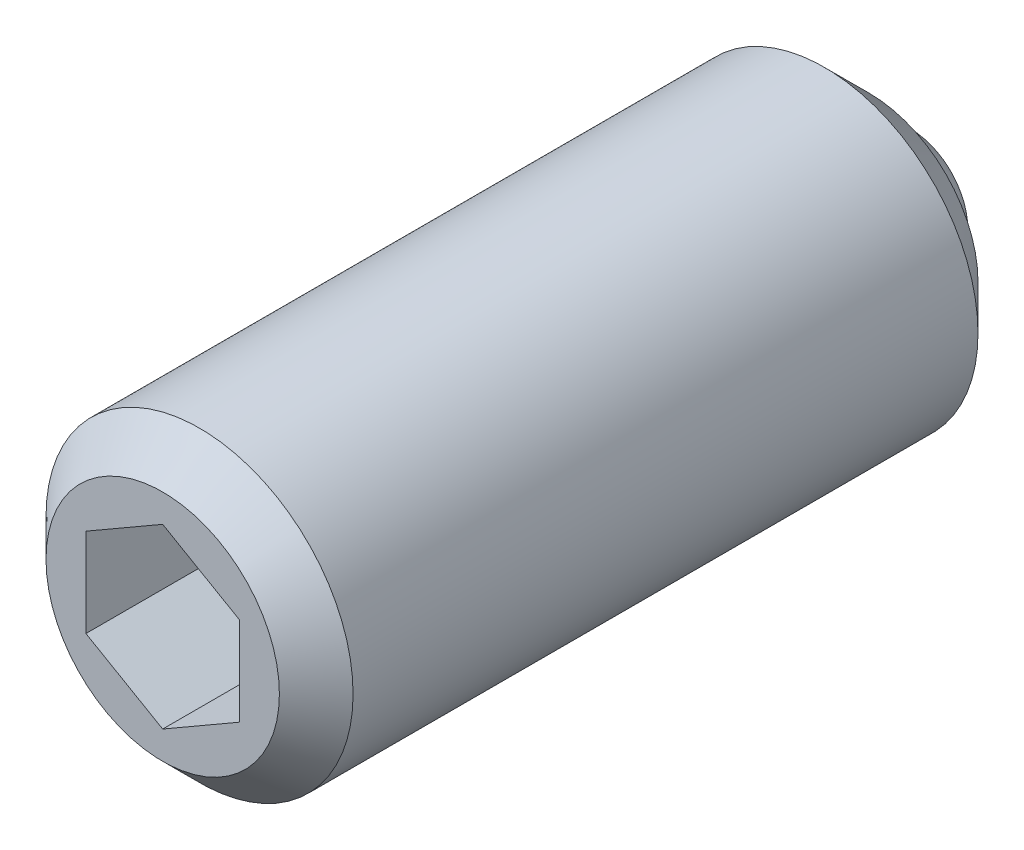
ISO-10303-21;
HEADER;
FILE_DESCRIPTION(('STEP AP214'),'2;1');
FILE_NAME('part.step','',(''),(''),'','','');
FILE_SCHEMA(('AUTOMOTIVE_DESIGN { 1 0 10303 214 1 1 1 1 }'));
ENDSEC;
DATA;
#1=APPLICATION_CONTEXT('core data for automotive mechanical design processes');
#2=APPLICATION_PROTOCOL_DEFINITION('international standard','automotive_design',2000,#1);
#3=PRODUCT_CONTEXT('',#1,'mechanical');
#4=PRODUCT('Part','Part','',(#3));
#5=PRODUCT_RELATED_PRODUCT_CATEGORY('part','',(#4));
#6=PRODUCT_DEFINITION_FORMATION('','',#4);
#7=PRODUCT_DEFINITION_CONTEXT('part definition',#1,'design');
#8=PRODUCT_DEFINITION('design','',#6,#7);
#9=PRODUCT_DEFINITION_SHAPE('','',#8);
#10=(LENGTH_UNIT() NAMED_UNIT(*) SI_UNIT(.MILLI.,.METRE.));
#11=(NAMED_UNIT(*) PLANE_ANGLE_UNIT() SI_UNIT($,.RADIAN.));
#12=(NAMED_UNIT(*) SI_UNIT($,.STERADIAN.) SOLID_ANGLE_UNIT());
#13=UNCERTAINTY_MEASURE_WITH_UNIT(LENGTH_MEASURE(1.E-05),#10,'distance_accuracy_value','');
#14=(GEOMETRIC_REPRESENTATION_CONTEXT(3) GLOBAL_UNCERTAINTY_ASSIGNED_CONTEXT((#13)) GLOBAL_UNIT_ASSIGNED_CONTEXT((#10,
#11,#12)) REPRESENTATION_CONTEXT('',''));
#15=CARTESIAN_POINT('',(0.,0.,0.));
#16=DIRECTION('',(0.,0.,1.));
#17=DIRECTION('',(1.,0.,0.));
#18=AXIS2_PLACEMENT_3D('',#15,#16,#17);
#19=CARTESIAN_POINT('',(2.500000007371,-2.92139236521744,20.9999999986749));
#20=DIRECTION('',(-3.50999936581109E-10,1.53211644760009E-10,-1.));
#21=DIRECTION('',(-1.,0.,3.50999936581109E-10));
#22=AXIS2_PLACEMENT_3D('',#19,#20,#21);
#23=PLANE('',#22);
#24=DIRECTION('',(-0.866025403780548,-0.500000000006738,2.27369039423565E-10));
#25=VECTOR('',#24,1.);
#26=CARTESIAN_POINT('',(-1.249999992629,2.16506350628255,21.0000000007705));
#27=LINE('',#26,#25);
#28=CARTESIAN_POINT('',(6.66551176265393E-09,2.88675134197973,21.0000000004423));
#29=VERTEX_POINT('',#28);
#30=CARTESIAN_POINT('',(-2.499999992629,1.44337566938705,21.0000000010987));
#31=VERTEX_POINT('',#30);
#32=EDGE_CURVE('E160',#29,#31,#27,.T.);
#33=ORIENTED_EDGE('',*,*,#32,.T.);
#34=DIRECTION('',(0.,-1.,-1.53211644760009E-10));
#35=VECTOR('',#34,1.);
#36=CARTESIAN_POINT('',(-2.499999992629,-3.21744416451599E-09,21.0000000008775));
#37=LINE('',#36,#35);
#38=CARTESIAN_POINT('',(-2.499999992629,-1.44337567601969,21.0000000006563));
#39=VERTEX_POINT('',#38);
#40=EDGE_CURVE('E162',#31,#39,#37,.T.);
#41=ORIENTED_EDGE('',*,*,#40,.T.);
#42=DIRECTION('',(0.866025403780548,-0.500000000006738,-3.80580684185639E-10));
#43=VECTOR('',#42,1.);
#44=CARTESIAN_POINT('',(-1.249999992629,-2.16506351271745,21.0000000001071));
#45=LINE('',#44,#43);
#46=CARTESIAN_POINT('',(8.07648570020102E-09,-2.88675134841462,20.9999999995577));
#47=VERTEX_POINT('',#46);
#48=EDGE_CURVE('E72',#39,#47,#45,.T.);
#49=ORIENTED_EDGE('',*,*,#48,.T.);
#50=DIRECTION('',(0.866025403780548,0.500000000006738,-2.27369039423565E-10));
#51=VECTOR('',#50,1.);
#52=CARTESIAN_POINT('',(1.250000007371,-2.16506351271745,20.9999999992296));
#53=LINE('',#52,#51);
#54=CARTESIAN_POINT('',(2.500000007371,-1.44337567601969,20.9999999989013));
#55=VERTEX_POINT('',#54);
#56=EDGE_CURVE('E71',#47,#55,#53,.T.);
#57=ORIENTED_EDGE('',*,*,#56,.T.);
#58=DIRECTION('',(0.,1.,1.53211644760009E-10));
#59=VECTOR('',#58,1.);
#60=CARTESIAN_POINT('',(2.500000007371,-3.21744491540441E-09,20.9999999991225));
#61=LINE('',#60,#59);
#62=CARTESIAN_POINT('',(2.500000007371,1.4433756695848,20.9999999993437));
#63=VERTEX_POINT('',#62);
#64=EDGE_CURVE('E165',#55,#63,#61,.T.);
#65=ORIENTED_EDGE('',*,*,#64,.T.);
#66=DIRECTION('',(-0.866025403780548,0.500000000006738,3.80580684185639E-10));
#67=VECTOR('',#66,1.);
#68=CARTESIAN_POINT('',(1.250000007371,2.16506350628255,20.999999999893));
#69=LINE('',#68,#67);
#70=EDGE_CURVE('E170',#63,#29,#69,.T.);
#71=ORIENTED_EDGE('',*,*,#70,.T.);
#72=EDGE_LOOP('',(#33,#41,#49,#57,#65,#71));
#73=FACE_BOUND('',#72,.T.);
#74=ADVANCED_FACE('F14',(#73),#23,.F.);
#75=CARTESIAN_POINT('',(-2.499999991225,1.44337566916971,25.0000000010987));
#76=DIRECTION('',(-0.500000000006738,0.866025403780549,3.08185144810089E-10));
#77=DIRECTION('',(0.866025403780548,0.500000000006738,-2.27369039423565E-10));
#78=AXIS2_PLACEMENT_3D('',#75,#76,#77);
#79=PLANE('',#78);
#80=DIRECTION('',(3.50999936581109E-10,-1.53211644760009E-10,1.));
#81=VECTOR('',#80,1.);
#82=CARTESIAN_POINT('',(-2.499999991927,1.44337566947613,23.0000000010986));
#83=LINE('',#82,#81);
#84=CARTESIAN_POINT('',(-2.499999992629,1.44337566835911,25.0000000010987));
#85=VERTEX_POINT('',#84);
#86=EDGE_CURVE('E158',#31,#85,#83,.T.);
#87=ORIENTED_EDGE('',*,*,#86,.F.);
#88=ORIENTED_EDGE('',*,*,#32,.F.);
#89=DIRECTION('',(-3.50999936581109E-10,1.53211644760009E-10,-1.));
#90=VECTOR('',#89,1.);
#91=CARTESIAN_POINT('',(8.07299896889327E-09,2.88675134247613,23.0000000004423));
#92=LINE('',#91,#90);
#93=CARTESIAN_POINT('',(8.77499874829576E-09,2.88675134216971,25.0000000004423));
#94=VERTEX_POINT('',#93);
#95=EDGE_CURVE('E167',#94,#29,#92,.T.);
#96=ORIENTED_EDGE('',*,*,#95,.F.);
#97=DIRECTION('',(0.866025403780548,0.500000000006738,-2.27369039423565E-10));
#98=VECTOR('',#97,1.);
#99=CARTESIAN_POINT('',(-2.499999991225,1.44337566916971,25.0000000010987));
#100=LINE('',#99,#98);
#101=EDGE_CURVE('E154',#94,#85,#100,.F.);
#102=ORIENTED_EDGE('',*,*,#101,.T.);
#103=EDGE_LOOP('',(#87,#88,#96,#102));
#104=FACE_BOUND('',#103,.T.);
#105=ADVANCED_FACE('F107',(#104),#79,.F.);
#106=CARTESIAN_POINT('',(-2.499999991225,-1.44337567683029,25.0000000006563));
#107=DIRECTION('',(-1.,0.,3.50999936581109E-10));
#108=DIRECTION('',(0.,1.,1.53211644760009E-10));
#109=AXIS2_PLACEMENT_3D('',#106,#107,#108);
#110=PLANE('',#109);
#111=DIRECTION('',(-3.50999936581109E-10,1.53211644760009E-10,-1.));
#112=VECTOR('',#111,1.);
#113=CARTESIAN_POINT('',(-2.499999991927,-1.44337567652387,23.0000000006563));
#114=LINE('',#113,#112);
#115=CARTESIAN_POINT('',(-2.499999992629,-1.44337567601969,25.0000000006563));
#116=VERTEX_POINT('',#115);
#117=EDGE_CURVE('E61',#116,#39,#114,.T.);
#118=ORIENTED_EDGE('',*,*,#117,.T.);
#119=ORIENTED_EDGE('',*,*,#40,.F.);
#120=ORIENTED_EDGE('',*,*,#86,.T.);
#121=DIRECTION('',(0.,-1.,-1.53211644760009E-10));
#122=VECTOR('',#121,1.);
#123=CARTESIAN_POINT('',(-2.499999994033,-3.83029074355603E-09,25.0000000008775));
#124=LINE('',#123,#122);
#125=EDGE_CURVE('E48',#85,#116,#124,.T.);
#126=ORIENTED_EDGE('',*,*,#125,.T.);
#127=EDGE_LOOP('',(#118,#119,#120,#126));
#128=FACE_BOUND('',#127,.T.);
#129=ADVANCED_FACE('F114',(#128),#110,.F.);
#130=CARTESIAN_POINT('',(8.77499797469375E-09,-2.88675134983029,24.9999999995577));
#131=DIRECTION('',(-0.500000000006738,-0.866025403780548,4.28147917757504E-11));
#132=DIRECTION('',(-0.866025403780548,0.500000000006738,3.80580684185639E-10));
#133=AXIS2_PLACEMENT_3D('',#130,#131,#132);
#134=PLANE('',#133);
#135=DIRECTION('',(-3.50999936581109E-10,1.53211644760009E-10,-1.));
#136=VECTOR('',#135,1.);
#137=CARTESIAN_POINT('',(8.07299810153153E-09,-2.88675134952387,22.9999999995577));
#138=LINE('',#137,#136);
#139=CARTESIAN_POINT('',(8.77499806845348E-09,-2.88675134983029,24.9999999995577));
#140=VERTEX_POINT('',#139);
#141=EDGE_CURVE('E59',#140,#47,#138,.T.);
#142=ORIENTED_EDGE('',*,*,#141,.T.);
#143=ORIENTED_EDGE('',*,*,#48,.F.);
#144=ORIENTED_EDGE('',*,*,#117,.F.);
#145=DIRECTION('',(-0.866025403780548,0.500000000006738,3.80580684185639E-10));
#146=VECTOR('',#145,1.);
#147=CARTESIAN_POINT('',(8.77499797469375E-09,-2.88675134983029,24.9999999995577));
#148=LINE('',#147,#146);
#149=EDGE_CURVE('E54',#116,#140,#148,.F.);
#150=ORIENTED_EDGE('',*,*,#149,.T.);
#151=EDGE_LOOP('',(#142,#143,#144,#150));
#152=FACE_BOUND('',#151,.T.);
#153=ADVANCED_FACE('F56',(#152),#134,.F.);
#154=CARTESIAN_POINT('',(2.500000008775,-1.44337567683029,24.9999999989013));
#155=DIRECTION('',(0.500000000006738,-0.866025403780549,-3.08185144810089E-10));
#156=DIRECTION('',(-0.866025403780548,-0.500000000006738,2.27369039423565E-10));
#157=AXIS2_PLACEMENT_3D('',#154,#155,#156);
#158=PLANE('',#157);
#159=DIRECTION('',(-3.50999936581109E-10,1.53211644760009E-10,-1.));
#160=VECTOR('',#159,1.);
#161=CARTESIAN_POINT('',(2.500000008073,-1.44337567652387,22.9999999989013));
#162=LINE('',#161,#160);
#163=CARTESIAN_POINT('',(2.500000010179,-1.44337567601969,24.9999999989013));
#164=VERTEX_POINT('',#163);
#165=EDGE_CURVE('E164',#164,#55,#162,.T.);
#166=ORIENTED_EDGE('',*,*,#165,.T.);
#167=ORIENTED_EDGE('',*,*,#56,.F.);
#168=ORIENTED_EDGE('',*,*,#141,.F.);
#169=DIRECTION('',(-0.866025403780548,-0.500000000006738,2.27369039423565E-10));
#170=VECTOR('',#169,1.);
#171=CARTESIAN_POINT('',(2.500000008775,-1.44337567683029,24.9999999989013));
#172=LINE('',#171,#170);
#173=EDGE_CURVE('E64',#140,#164,#172,.F.);
#174=ORIENTED_EDGE('',*,*,#173,.T.);
#175=EDGE_LOOP('',(#166,#167,#168,#174));
#176=FACE_BOUND('',#175,.T.);
#177=ADVANCED_FACE('F68',(#176),#158,.F.);
#178=CARTESIAN_POINT('',(2.500000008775,1.44337566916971,24.9999999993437));
#179=DIRECTION('',(1.,0.,-3.50999936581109E-10));
#180=DIRECTION('',(0.,-1.,-1.53211644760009E-10));
#181=AXIS2_PLACEMENT_3D('',#178,#179,#180);
#182=PLANE('',#181);
#183=DIRECTION('',(-3.50999936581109E-10,1.53211644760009E-10,-1.));
#184=VECTOR('',#183,1.);
#185=CARTESIAN_POINT('',(2.500000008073,1.44337566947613,22.9999999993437));
#186=LINE('',#185,#184);
#187=CARTESIAN_POINT('',(2.500000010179,1.44337566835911,24.9999999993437));
#188=VERTEX_POINT('',#187);
#189=EDGE_CURVE('E171',#188,#63,#186,.T.);
#190=ORIENTED_EDGE('',*,*,#189,.T.);
#191=ORIENTED_EDGE('',*,*,#64,.F.);
#192=ORIENTED_EDGE('',*,*,#165,.F.);
#193=DIRECTION('',(0.,1.,1.53211644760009E-10));
#194=VECTOR('',#193,1.);
#195=CARTESIAN_POINT('',(2.500000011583,-3.83029149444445E-09,24.9999999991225));
#196=LINE('',#195,#194);
#197=EDGE_CURVE('E77',#164,#188,#196,.T.);
#198=ORIENTED_EDGE('',*,*,#197,.T.);
#199=EDGE_LOOP('',(#190,#191,#192,#198));
#200=FACE_BOUND('',#199,.T.);
#201=ADVANCED_FACE('F129',(#200),#182,.F.);
#202=CARTESIAN_POINT('',(8.77499884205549E-09,2.88675134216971,25.0000000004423));
#203=DIRECTION('',(0.500000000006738,0.866025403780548,-4.28147917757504E-11));
#204=DIRECTION('',(0.866025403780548,-0.500000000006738,-3.80580684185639E-10));
#205=AXIS2_PLACEMENT_3D('',#202,#203,#204);
#206=PLANE('',#205);
#207=ORIENTED_EDGE('',*,*,#95,.T.);
#208=ORIENTED_EDGE('',*,*,#70,.F.);
#209=ORIENTED_EDGE('',*,*,#189,.F.);
#210=DIRECTION('',(0.866025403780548,-0.500000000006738,-3.80580684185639E-10));
#211=VECTOR('',#210,1.);
#212=CARTESIAN_POINT('',(8.77499884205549E-09,2.88675134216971,25.0000000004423));
#213=LINE('',#212,#211);
#214=EDGE_CURVE('E79',#188,#94,#213,.F.);
#215=ORIENTED_EDGE('',*,*,#214,.T.);
#216=EDGE_LOOP('',(#207,#208,#209,#215));
#217=FACE_BOUND('',#216,.T.);
#218=ADVANCED_FACE('F132',(#217),#206,.F.);
#219=CARTESIAN_POINT('',(3.542000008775,-3.55418791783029,24.9999999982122));
#220=DIRECTION('',(-3.50999936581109E-10,1.53211644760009E-10,-1.));
#221=DIRECTION('',(-1.,0.,3.50999936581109E-10));
#222=AXIS2_PLACEMENT_3D('',#219,#220,#221);
#223=PLANE('',#222);
#224=CARTESIAN_POINT('',(8.77499840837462E-09,-3.83029111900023E-09,25.));
#225=DIRECTION('',(-3.50999936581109E-10,1.53211644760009E-10,-1.));
#226=DIRECTION('',(-1.,0.,3.50999936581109E-10));
#227=AXIS2_PLACEMENT_3D('',#224,#225,#226);
#228=CIRCLE('',#227,3.8);
#229=CARTESIAN_POINT('',(-3.799999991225,-3.83029111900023E-09,25.0000000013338));
#230=VERTEX_POINT('',#229);
#231=EDGE_CURVE('E84',#230,#230,#228,.F.);
#232=ORIENTED_EDGE('',*,*,#231,.T.);
#233=EDGE_LOOP('',(#232));
#234=FACE_BOUND('',#233,.T.);
#235=ORIENTED_EDGE('',*,*,#214,.F.);
#236=ORIENTED_EDGE('',*,*,#197,.F.);
#237=ORIENTED_EDGE('',*,*,#173,.F.);
#238=ORIENTED_EDGE('',*,*,#149,.F.);
#239=ORIENTED_EDGE('',*,*,#125,.F.);
#240=ORIENTED_EDGE('',*,*,#101,.F.);
#241=EDGE_LOOP('',(#235,#236,#237,#238,#239,#240));
#242=FACE_BOUND('',#241,.T.);
#243=ADVANCED_FACE('F76',(#234,#242),#223,.F.);
#244=CARTESIAN_POINT('',(1.37388871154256E-08,-5.99703097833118E-09,39.142135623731));
#245=DIRECTION('',(-3.50999936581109E-10,1.53211644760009E-10,-1.));
#246=DIRECTION('',(-1.,0.,3.50999936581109E-10));
#247=AXIS2_PLACEMENT_3D('',#244,#245,#246);
#248=CYLINDRICAL_SURFACE('',#247,5.);
#249=CARTESIAN_POINT('',(1.21094977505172E-09,-5.28580174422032E-10,3.45));
#250=DIRECTION('',(3.50999936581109E-10,-1.53211644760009E-10,1.));
#251=DIRECTION('',(1.,0.,-3.50999936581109E-10));
#252=AXIS2_PLACEMENT_3D('',#249,#250,#251);
#253=CIRCLE('',#252,5.);
#254=CARTESIAN_POINT('',(5.00000000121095,-5.28580174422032E-10,3.449999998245));
#255=VERTEX_POINT('',#254);
#256=EDGE_CURVE('E9',#255,#255,#253,.T.);
#257=ORIENTED_EDGE('',*,*,#256,.T.);
#258=EDGE_LOOP('',(#257));
#259=FACE_BOUND('',#258,.T.);
#260=CARTESIAN_POINT('',(8.35379848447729E-09,-3.64643714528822E-09,23.8));
#261=DIRECTION('',(-3.50999936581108E-10,1.5321164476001E-10,-1.));
#262=DIRECTION('',(-1.,0.,3.50999936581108E-10));
#263=AXIS2_PLACEMENT_3D('',#260,#261,#262);
#264=CIRCLE('',#263,5.);
#265=CARTESIAN_POINT('',(-4.9999999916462,-3.64643714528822E-09,23.800000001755));
#266=VERTEX_POINT('',#265);
#267=EDGE_CURVE('E87',#266,#266,#264,.T.);
#268=ORIENTED_EDGE('',*,*,#267,.T.);
#269=EDGE_LOOP('',(#268));
#270=FACE_BOUND('',#269,.T.);
#271=ADVANCED_FACE('F139',(#259,#270),#248,.T.);
#272=CARTESIAN_POINT('',(1.05299980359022E-09,-4.59634934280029E-10,3.));
#273=DIRECTION('',(3.50999936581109E-10,-1.53211644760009E-10,1.));
#274=DIRECTION('',(0.,1.,1.53211644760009E-10));
#275=AXIS2_PLACEMENT_3D('',#272,#273,#274);
#276=SPHERICAL_SURFACE('',#275,3.);
#277=CARTESIAN_POINT('',(0.,-3.E-08,0.));
#278=VERTEX_POINT('',#277);
#279=VERTEX_LOOP('',#278);
#280=FACE_BOUND('',#279,.T.);
#281=CARTESIAN_POINT('',(7.01999867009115E-10,-3.06423289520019E-10,2.));
#282=DIRECTION('',(3.50999936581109E-10,-1.53211644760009E-10,1.));
#283=DIRECTION('',(1.,0.,-3.50999936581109E-10));
#284=AXIS2_PLACEMENT_3D('',#281,#282,#283);
#285=CIRCLE('',#284,2.82842712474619);
#286=CARTESIAN_POINT('',(2.82842712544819,-3.0642371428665E-10,1.99999999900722));
#287=VERTEX_POINT('',#286);
#288=EDGE_CURVE('E88',#287,#287,#285,.F.);
#289=ORIENTED_EDGE('',*,*,#288,.T.);
#290=EDGE_LOOP('',(#289));
#291=FACE_BOUND('',#290,.T.);
#292=ADVANCED_FACE('F120',(#280,#291),#276,.T.);
#293=CARTESIAN_POINT('',(-3.592599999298,-3.60496202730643,2.00000000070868));
#294=DIRECTION('',(3.50999936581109E-10,-1.53211644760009E-10,1.));
#295=DIRECTION('',(1.,0.,-3.50999936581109E-10));
#296=AXIS2_PLACEMENT_3D('',#293,#294,#295);
#297=PLANE('',#296);
#298=CARTESIAN_POINT('',(7.01999867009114E-10,-3.06423289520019E-10,2.));
#299=DIRECTION('',(3.50999936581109E-10,-1.53211644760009E-10,1.));
#300=DIRECTION('',(1.,0.,-3.50999936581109E-10));
#301=AXIS2_PLACEMENT_3D('',#298,#299,#300);
#302=CIRCLE('',#301,3.55);
#303=CARTESIAN_POINT('',(3.550000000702,-3.06423289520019E-10,1.99999999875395));
#304=VERTEX_POINT('',#303);
#305=EDGE_CURVE('E23',#304,#304,#302,.F.);
#306=ORIENTED_EDGE('',*,*,#305,.T.);
#307=EDGE_LOOP('',(#306));
#308=FACE_BOUND('',#307,.T.);
#309=ORIENTED_EDGE('',*,*,#288,.F.);
#310=EDGE_LOOP('',(#309));
#311=FACE_BOUND('',#310,.T.);
#312=ADVANCED_FACE('F93',(#308,#311),#297,.F.);
#313=CARTESIAN_POINT('',(8.77499840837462E-09,-3.83029111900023E-09,25.));
#314=DIRECTION('',(-3.50999936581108E-10,1.5321164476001E-10,-1.));
#315=DIRECTION('',(-1.,0.,3.50999936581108E-10));
#316=AXIS2_PLACEMENT_3D('',#313,#314,#315);
#317=CONICAL_SURFACE('',#316,3.8,0.785398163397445);
#318=ORIENTED_EDGE('',*,*,#267,.F.);
#319=EDGE_LOOP('',(#318));
#320=FACE_BOUND('',#319,.T.);
#321=ORIENTED_EDGE('',*,*,#231,.F.);
#322=EDGE_LOOP('',(#321));
#323=FACE_BOUND('',#322,.T.);
#324=ADVANCED_FACE('F97',(#320,#323),#317,.T.);
#325=CARTESIAN_POINT('',(7.01999867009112E-10,-3.06423289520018E-10,2.));
#326=DIRECTION('',(3.50999936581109E-10,-1.53211644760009E-10,1.));
#327=DIRECTION('',(1.,0.,-3.50999936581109E-10));
#328=AXIS2_PLACEMENT_3D('',#325,#326,#327);
#329=CONICAL_SURFACE('',#328,3.55,0.785398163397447);
#330=ORIENTED_EDGE('',*,*,#256,.F.);
#331=EDGE_LOOP('',(#330));
#332=FACE_BOUND('',#331,.T.);
#333=ORIENTED_EDGE('',*,*,#305,.F.);
#334=EDGE_LOOP('',(#333));
#335=FACE_BOUND('',#334,.T.);
#336=ADVANCED_FACE('F16',(#332,#335),#329,.T.);
#337=CLOSED_SHELL('',(#74,#105,#129,#153,#177,#201,#218,#243,#271,#292,#312,#324,#336));
#338=MANIFOLD_SOLID_BREP('B1',#337);
#339=ADVANCED_BREP_SHAPE_REPRESENTATION('',(#18,#338),#14);
#340=SHAPE_DEFINITION_REPRESENTATION(#9,#339);
ENDSEC;
END-ISO-10303-21;
